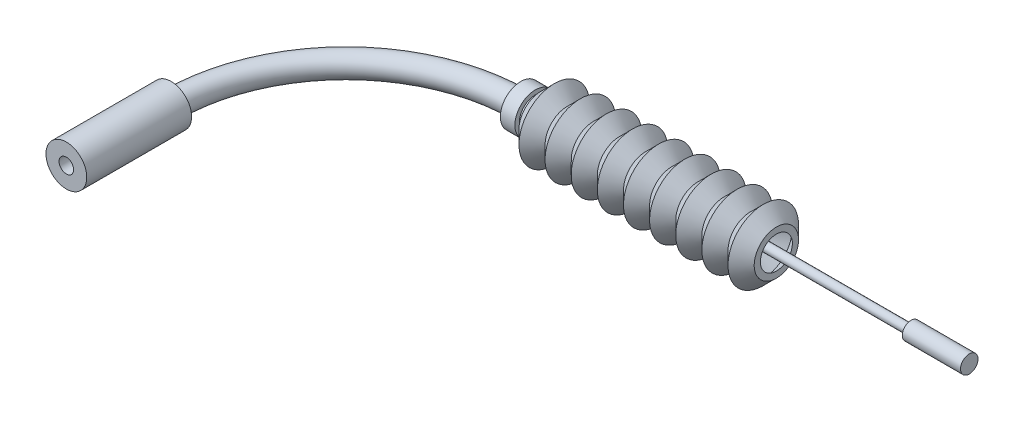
ISO-10303-21;
HEADER;
FILE_DESCRIPTION(('STEP AP214'),'2;1');
FILE_NAME('part.step','',(''),(''),'','','');
FILE_SCHEMA(('AUTOMOTIVE_DESIGN { 1 0 10303 214 1 1 1 1 }'));
ENDSEC;
DATA;
#1=APPLICATION_CONTEXT('core data for automotive mechanical design processes');
#2=APPLICATION_PROTOCOL_DEFINITION('international standard','automotive_design',2000,#1);
#3=PRODUCT_CONTEXT('',#1,'mechanical');
#4=PRODUCT('Part','Part','',(#3));
#5=PRODUCT_RELATED_PRODUCT_CATEGORY('part','',(#4));
#6=PRODUCT_DEFINITION_FORMATION('','',#4);
#7=PRODUCT_DEFINITION_CONTEXT('part definition',#1,'design');
#8=PRODUCT_DEFINITION('design','',#6,#7);
#9=PRODUCT_DEFINITION_SHAPE('','',#8);
#10=(LENGTH_UNIT() NAMED_UNIT(*) SI_UNIT(.MILLI.,.METRE.));
#11=(NAMED_UNIT(*) PLANE_ANGLE_UNIT() SI_UNIT($,.RADIAN.));
#12=(NAMED_UNIT(*) SI_UNIT($,.STERADIAN.) SOLID_ANGLE_UNIT());
#13=UNCERTAINTY_MEASURE_WITH_UNIT(LENGTH_MEASURE(1.E-05),#10,'distance_accuracy_value','');
#14=(GEOMETRIC_REPRESENTATION_CONTEXT(3) GLOBAL_UNCERTAINTY_ASSIGNED_CONTEXT((#13)) GLOBAL_UNIT_ASSIGNED_CONTEXT((#10,
#11,#12)) REPRESENTATION_CONTEXT('',''));
#15=CARTESIAN_POINT('',(0.,0.,0.));
#16=DIRECTION('',(0.,0.,1.));
#17=DIRECTION('',(1.,0.,0.));
#18=AXIS2_PLACEMENT_3D('',#15,#16,#17);
#19=CARTESIAN_POINT('',(77.,0.,-30.));
#20=DIRECTION('',(-1.,0.,0.));
#21=DIRECTION('',(0.,0.,1.));
#22=AXIS2_PLACEMENT_3D('',#19,#20,#21);
#23=CYLINDRICAL_SURFACE('',#22,0.750000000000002);
#24=CARTESIAN_POINT('',(7.,0.,-30.));
#25=DIRECTION('',(1.,0.,0.));
#26=DIRECTION('',(0.,0.,-1.));
#27=AXIS2_PLACEMENT_3D('',#24,#25,#26);
#28=CIRCLE('',#27,0.750000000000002);
#29=CARTESIAN_POINT('',(7.,0.,-30.75));
#30=VERTEX_POINT('',#29);
#31=EDGE_CURVE('E47',#30,#30,#28,.T.);
#32=ORIENTED_EDGE('',*,*,#31,.T.);
#33=EDGE_LOOP('',(#32));
#34=FACE_BOUND('',#33,.T.);
#35=CARTESIAN_POINT('',(67.,0.,-30.));
#36=DIRECTION('',(1.,0.,0.));
#37=DIRECTION('',(0.,0.,-1.));
#38=AXIS2_PLACEMENT_3D('',#35,#36,#37);
#39=CIRCLE('',#38,0.750000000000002);
#40=CARTESIAN_POINT('',(67.,0.,-30.75));
#41=VERTEX_POINT('',#40);
#42=EDGE_CURVE('E11',#41,#41,#39,.T.);
#43=ORIENTED_EDGE('',*,*,#42,.F.);
#44=EDGE_LOOP('',(#43));
#45=FACE_BOUND('',#44,.T.);
#46=ADVANCED_FACE('F41',(#34,#45),#23,.T.);
#47=CARTESIAN_POINT('',(7.,0.,-30.));
#48=DIRECTION('',(1.,0.,0.));
#49=DIRECTION('',(0.,0.,-1.));
#50=AXIS2_PLACEMENT_3D('',#47,#48,#49);
#51=PLANE('',#50);
#52=ORIENTED_EDGE('',*,*,#31,.F.);
#53=EDGE_LOOP('',(#52));
#54=FACE_BOUND('',#53,.T.);
#55=ADVANCED_FACE('F72',(#54),#51,.F.);
#56=CARTESIAN_POINT('',(67.,0.,-30.));
#57=DIRECTION('',(1.,0.,0.));
#58=DIRECTION('',(0.,0.,-1.));
#59=AXIS2_PLACEMENT_3D('',#56,#57,#58);
#60=PLANE('',#59);
#61=CARTESIAN_POINT('',(67.,0.,-30.));
#62=DIRECTION('',(1.,0.,0.));
#63=DIRECTION('',(0.,0.,-1.));
#64=AXIS2_PLACEMENT_3D('',#61,#62,#63);
#65=CIRCLE('',#64,1.5);
#66=CARTESIAN_POINT('',(67.,0.,-31.5));
#67=VERTEX_POINT('',#66);
#68=EDGE_CURVE('E51',#67,#67,#65,.T.);
#69=ORIENTED_EDGE('',*,*,#68,.F.);
#70=EDGE_LOOP('',(#69));
#71=FACE_BOUND('',#70,.T.);
#72=ORIENTED_EDGE('',*,*,#42,.T.);
#73=EDGE_LOOP('',(#72));
#74=FACE_BOUND('',#73,.T.);
#75=ADVANCED_FACE('F65',(#71,#74),#60,.F.);
#76=CARTESIAN_POINT('',(67.,0.,-30.));
#77=DIRECTION('',(1.,0.,0.));
#78=DIRECTION('',(0.,0.,-1.));
#79=AXIS2_PLACEMENT_3D('',#76,#77,#78);
#80=CYLINDRICAL_SURFACE('',#79,1.5);
#81=ORIENTED_EDGE('',*,*,#68,.T.);
#82=EDGE_LOOP('',(#81));
#83=FACE_BOUND('',#82,.T.);
#84=CARTESIAN_POINT('',(77.,0.,-30.));
#85=DIRECTION('',(1.,0.,0.));
#86=DIRECTION('',(0.,0.,-1.));
#87=AXIS2_PLACEMENT_3D('',#84,#85,#86);
#88=CIRCLE('',#87,1.5);
#89=CARTESIAN_POINT('',(77.,0.,-31.5));
#90=VERTEX_POINT('',#89);
#91=EDGE_CURVE('E55',#90,#90,#88,.T.);
#92=ORIENTED_EDGE('',*,*,#91,.F.);
#93=EDGE_LOOP('',(#92));
#94=FACE_BOUND('',#93,.T.);
#95=ADVANCED_FACE('F63',(#83,#94),#80,.T.);
#96=CARTESIAN_POINT('',(77.,0.,-30.));
#97=DIRECTION('',(1.,0.,0.));
#98=DIRECTION('',(0.,0.,-1.));
#99=AXIS2_PLACEMENT_3D('',#96,#97,#98);
#100=PLANE('',#99);
#101=ORIENTED_EDGE('',*,*,#91,.T.);
#102=EDGE_LOOP('',(#101));
#103=FACE_BOUND('',#102,.T.);
#104=ADVANCED_FACE('F61',(#103),#100,.T.);
#105=CLOSED_SHELL('',(#46,#55,#75,#95,#104));
#106=MANIFOLD_SOLID_BREP('B2',#105);
#107=CARTESIAN_POINT('',(28.1772718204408,0.,-30.));
#108=DIRECTION('',(1.,0.,0.));
#109=DIRECTION('',(0.,0.,-1.));
#110=AXIS2_PLACEMENT_3D('',#107,#108,#109);
#111=CONICAL_SURFACE('',#110,6.05165995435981,0.787019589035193);
#112=CARTESIAN_POINT('',(25.9418174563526,0.,-30.));
#113=DIRECTION('',(1.,0.,0.));
#114=DIRECTION('',(0.,0.,-1.));
#115=AXIS2_PLACEMENT_3D('',#112,#113,#114);
#116=CIRCLE('',#115,3.80894456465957);
#117=CARTESIAN_POINT('',(25.9418174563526,0.,-33.8089445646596));
#118=VERTEX_POINT('',#117);
#119=EDGE_CURVE('E240',#118,#118,#116,.T.);
#120=ORIENTED_EDGE('',*,*,#119,.T.);
#121=EDGE_LOOP('',(#120));
#122=FACE_BOUND('',#121,.T.);
#123=CARTESIAN_POINT('',(28.1772718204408,0.,-30.));
#124=DIRECTION('',(1.,0.,0.));
#125=DIRECTION('',(0.,0.,-1.));
#126=AXIS2_PLACEMENT_3D('',#123,#124,#125);
#127=CIRCLE('',#126,6.05165995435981);
#128=CARTESIAN_POINT('',(28.1772718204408,0.,-36.0516599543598));
#129=VERTEX_POINT('',#128);
#130=EDGE_CURVE('E40',#129,#129,#127,.T.);
#131=ORIENTED_EDGE('',*,*,#130,.F.);
#132=EDGE_LOOP('',(#131));
#133=FACE_BOUND('',#132,.T.);
#134=ADVANCED_FACE('F122',(#122,#133),#111,.T.);
#135=CARTESIAN_POINT('',(30.4272718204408,0.,-30.));
#136=DIRECTION('',(-1.,0.,0.));
#137=DIRECTION('',(0.,0.,1.));
#138=AXIS2_PLACEMENT_3D('',#135,#136,#137);
#139=CONICAL_SURFACE('',#138,3.80894456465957,0.783776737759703);
#140=ORIENTED_EDGE('',*,*,#130,.T.);
#141=EDGE_LOOP('',(#140));
#142=FACE_BOUND('',#141,.T.);
#143=CARTESIAN_POINT('',(30.4272718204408,0.,-30.));
#144=DIRECTION('',(1.,0.,0.));
#145=DIRECTION('',(0.,0.,-1.));
#146=AXIS2_PLACEMENT_3D('',#143,#144,#145);
#147=CIRCLE('',#146,3.80894456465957);
#148=CARTESIAN_POINT('',(30.4272718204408,0.,-33.8089445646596));
#149=VERTEX_POINT('',#148);
#150=EDGE_CURVE('E128',#149,#149,#147,.T.);
#151=ORIENTED_EDGE('',*,*,#150,.F.);
#152=EDGE_LOOP('',(#151));
#153=FACE_BOUND('',#152,.T.);
#154=ADVANCED_FACE('F258',(#142,#153),#139,.T.);
#155=CARTESIAN_POINT('',(32.6627261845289,0.,-30.));
#156=DIRECTION('',(1.,0.,0.));
#157=DIRECTION('',(0.,0.,-1.));
#158=AXIS2_PLACEMENT_3D('',#155,#156,#157);
#159=CONICAL_SURFACE('',#158,6.05165995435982,0.787019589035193);
#160=ORIENTED_EDGE('',*,*,#150,.T.);
#161=EDGE_LOOP('',(#160));
#162=FACE_BOUND('',#161,.T.);
#163=CARTESIAN_POINT('',(32.6627261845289,0.,-30.));
#164=DIRECTION('',(1.,0.,0.));
#165=DIRECTION('',(0.,0.,-1.));
#166=AXIS2_PLACEMENT_3D('',#163,#164,#165);
#167=CIRCLE('',#166,6.05165995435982);
#168=CARTESIAN_POINT('',(32.6627261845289,0.,-36.0516599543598));
#169=VERTEX_POINT('',#168);
#170=EDGE_CURVE('E132',#169,#169,#167,.T.);
#171=ORIENTED_EDGE('',*,*,#170,.F.);
#172=EDGE_LOOP('',(#171));
#173=FACE_BOUND('',#172,.T.);
#174=ADVANCED_FACE('F262',(#162,#173),#159,.T.);
#175=CARTESIAN_POINT('',(34.9127261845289,0.,-30.));
#176=DIRECTION('',(-1.,0.,0.));
#177=DIRECTION('',(0.,0.,1.));
#178=AXIS2_PLACEMENT_3D('',#175,#176,#177);
#179=CONICAL_SURFACE('',#178,3.80894456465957,0.783776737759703);
#180=ORIENTED_EDGE('',*,*,#170,.T.);
#181=EDGE_LOOP('',(#180));
#182=FACE_BOUND('',#181,.T.);
#183=CARTESIAN_POINT('',(34.9127261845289,0.,-30.));
#184=DIRECTION('',(1.,0.,0.));
#185=DIRECTION('',(0.,0.,-1.));
#186=AXIS2_PLACEMENT_3D('',#183,#184,#185);
#187=CIRCLE('',#186,3.80894456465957);
#188=CARTESIAN_POINT('',(34.9127261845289,0.,-33.8089445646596));
#189=VERTEX_POINT('',#188);
#190=EDGE_CURVE('E136',#189,#189,#187,.T.);
#191=ORIENTED_EDGE('',*,*,#190,.F.);
#192=EDGE_LOOP('',(#191));
#193=FACE_BOUND('',#192,.T.);
#194=ADVANCED_FACE('F266',(#182,#193),#179,.T.);
#195=CARTESIAN_POINT('',(37.1481805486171,0.,-30.));
#196=DIRECTION('',(1.,0.,0.));
#197=DIRECTION('',(0.,0.,-1.));
#198=AXIS2_PLACEMENT_3D('',#195,#196,#197);
#199=CONICAL_SURFACE('',#198,6.05165995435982,0.787019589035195);
#200=ORIENTED_EDGE('',*,*,#190,.T.);
#201=EDGE_LOOP('',(#200));
#202=FACE_BOUND('',#201,.T.);
#203=CARTESIAN_POINT('',(37.1481805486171,0.,-30.));
#204=DIRECTION('',(1.,0.,0.));
#205=DIRECTION('',(0.,0.,-1.));
#206=AXIS2_PLACEMENT_3D('',#203,#204,#205);
#207=CIRCLE('',#206,6.05165995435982);
#208=CARTESIAN_POINT('',(37.1481805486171,0.,-36.0516599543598));
#209=VERTEX_POINT('',#208);
#210=EDGE_CURVE('E141',#209,#209,#207,.T.);
#211=ORIENTED_EDGE('',*,*,#210,.F.);
#212=EDGE_LOOP('',(#211));
#213=FACE_BOUND('',#212,.T.);
#214=ADVANCED_FACE('F272',(#202,#213),#199,.T.);
#215=CARTESIAN_POINT('',(39.399900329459,0.,-30.));
#216=DIRECTION('',(-1.,0.,0.));
#217=DIRECTION('',(0.,0.,1.));
#218=AXIS2_PLACEMENT_3D('',#215,#216,#217);
#219=CONICAL_SURFACE('',#218,3.80723035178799,0.783776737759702);
#220=ORIENTED_EDGE('',*,*,#210,.T.);
#221=EDGE_LOOP('',(#220));
#222=FACE_BOUND('',#221,.T.);
#223=CARTESIAN_POINT('',(39.399900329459,0.,-30.));
#224=DIRECTION('',(1.,0.,0.));
#225=DIRECTION('',(0.,0.,-1.));
#226=AXIS2_PLACEMENT_3D('',#223,#224,#225);
#227=CIRCLE('',#226,3.80723035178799);
#228=CARTESIAN_POINT('',(39.399900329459,0.,-33.807230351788));
#229=VERTEX_POINT('',#228);
#230=EDGE_CURVE('E144',#229,#229,#227,.T.);
#231=ORIENTED_EDGE('',*,*,#230,.F.);
#232=EDGE_LOOP('',(#231));
#233=FACE_BOUND('',#232,.T.);
#234=ADVANCED_FACE('F276',(#222,#233),#219,.T.);
#235=CARTESIAN_POINT('',(41.6353546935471,0.,-30.));
#236=DIRECTION('',(1.,0.,0.));
#237=DIRECTION('',(0.,0.,-1.));
#238=AXIS2_PLACEMENT_3D('',#235,#236,#237);
#239=CONICAL_SURFACE('',#238,6.04994574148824,0.787019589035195);
#240=ORIENTED_EDGE('',*,*,#230,.T.);
#241=EDGE_LOOP('',(#240));
#242=FACE_BOUND('',#241,.T.);
#243=CARTESIAN_POINT('',(41.6353546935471,0.,-30.));
#244=DIRECTION('',(1.,0.,0.));
#245=DIRECTION('',(0.,0.,-1.));
#246=AXIS2_PLACEMENT_3D('',#243,#244,#245);
#247=CIRCLE('',#246,6.04994574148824);
#248=CARTESIAN_POINT('',(41.6353546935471,0.,-36.0499457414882));
#249=VERTEX_POINT('',#248);
#250=EDGE_CURVE('E147',#249,#249,#247,.T.);
#251=ORIENTED_EDGE('',*,*,#250,.F.);
#252=EDGE_LOOP('',(#251));
#253=FACE_BOUND('',#252,.T.);
#254=ADVANCED_FACE('F280',(#242,#253),#239,.T.);
#255=CARTESIAN_POINT('',(43.887074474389,0.,-30.));
#256=DIRECTION('',(-1.,0.,0.));
#257=DIRECTION('',(0.,0.,1.));
#258=AXIS2_PLACEMENT_3D('',#255,#256,#257);
#259=CONICAL_SURFACE('',#258,3.80551613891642,0.783776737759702);
#260=ORIENTED_EDGE('',*,*,#250,.T.);
#261=EDGE_LOOP('',(#260));
#262=FACE_BOUND('',#261,.T.);
#263=CARTESIAN_POINT('',(43.887074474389,0.,-30.));
#264=DIRECTION('',(1.,0.,0.));
#265=DIRECTION('',(0.,0.,-1.));
#266=AXIS2_PLACEMENT_3D('',#263,#264,#265);
#267=CIRCLE('',#266,3.80551613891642);
#268=CARTESIAN_POINT('',(43.887074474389,0.,-33.8055161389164));
#269=VERTEX_POINT('',#268);
#270=EDGE_CURVE('E150',#269,#269,#267,.T.);
#271=ORIENTED_EDGE('',*,*,#270,.F.);
#272=EDGE_LOOP('',(#271));
#273=FACE_BOUND('',#272,.T.);
#274=ADVANCED_FACE('F284',(#262,#273),#259,.T.);
#275=CARTESIAN_POINT('',(43.887074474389,3.80551613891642,-30.));
#276=DIRECTION('',(1.,0.,0.));
#277=DIRECTION('',(0.,0.,-1.));
#278=AXIS2_PLACEMENT_3D('',#275,#276,#277);
#279=PLANE('',#278);
#280=ORIENTED_EDGE('',*,*,#270,.T.);
#281=EDGE_LOOP('',(#280));
#282=FACE_BOUND('',#281,.T.);
#283=CARTESIAN_POINT('',(43.887074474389,0.,-30.));
#284=DIRECTION('',(1.,0.,0.));
#285=DIRECTION('',(0.,0.,-1.));
#286=AXIS2_PLACEMENT_3D('',#283,#284,#285);
#287=CIRCLE('',#286,2.74657157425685);
#288=CARTESIAN_POINT('',(43.887074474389,0.,-32.7465715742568));
#289=VERTEX_POINT('',#288);
#290=EDGE_CURVE('E153',#289,#289,#287,.T.);
#291=ORIENTED_EDGE('',*,*,#290,.F.);
#292=EDGE_LOOP('',(#291));
#293=FACE_BOUND('',#292,.T.);
#294=ADVANCED_FACE('F288',(#282,#293),#279,.T.);
#295=CARTESIAN_POINT('',(41.6370744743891,0.,-30.));
#296=DIRECTION('',(-1.,0.,0.));
#297=DIRECTION('',(0.,0.,1.));
#298=AXIS2_PLACEMENT_3D('',#295,#296,#297);
#299=CONICAL_SURFACE('',#298,4.98928696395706,0.783776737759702);
#300=ORIENTED_EDGE('',*,*,#290,.T.);
#301=EDGE_LOOP('',(#300));
#302=FACE_BOUND('',#301,.T.);
#303=CARTESIAN_POINT('',(41.6370744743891,0.,-30.));
#304=DIRECTION('',(1.,0.,0.));
#305=DIRECTION('',(0.,0.,-1.));
#306=AXIS2_PLACEMENT_3D('',#303,#304,#305);
#307=CIRCLE('',#306,4.98928696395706);
#308=CARTESIAN_POINT('',(41.6370744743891,0.,-34.9892869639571));
#309=VERTEX_POINT('',#308);
#310=EDGE_CURVE('E156',#309,#309,#307,.T.);
#311=ORIENTED_EDGE('',*,*,#310,.F.);
#312=EDGE_LOOP('',(#311));
#313=FACE_BOUND('',#312,.T.);
#314=ADVANCED_FACE('F292',(#302,#313),#299,.F.);
#315=CARTESIAN_POINT('',(39.4016201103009,0.,-30.));
#316=DIRECTION('',(1.,0.,0.));
#317=DIRECTION('',(0.,0.,-1.));
#318=AXIS2_PLACEMENT_3D('',#315,#316,#317);
#319=CONICAL_SURFACE('',#318,2.74657157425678,0.78701958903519);
#320=ORIENTED_EDGE('',*,*,#310,.T.);
#321=EDGE_LOOP('',(#320));
#322=FACE_BOUND('',#321,.T.);
#323=CARTESIAN_POINT('',(39.4016201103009,0.,-30.));
#324=DIRECTION('',(1.,0.,0.));
#325=DIRECTION('',(0.,0.,-1.));
#326=AXIS2_PLACEMENT_3D('',#323,#324,#325);
#327=CIRCLE('',#326,2.74657157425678);
#328=CARTESIAN_POINT('',(39.4016201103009,0.,-32.7465715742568));
#329=VERTEX_POINT('',#328);
#330=EDGE_CURVE('E159',#329,#329,#327,.T.);
#331=ORIENTED_EDGE('',*,*,#330,.F.);
#332=EDGE_LOOP('',(#331));
#333=FACE_BOUND('',#332,.T.);
#334=ADVANCED_FACE('F296',(#322,#333),#319,.F.);
#335=CARTESIAN_POINT('',(37.149900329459,0.,-30.));
#336=DIRECTION('',(-1.,0.,0.));
#337=DIRECTION('',(0.,0.,1.));
#338=AXIS2_PLACEMENT_3D('',#335,#336,#337);
#339=CONICAL_SURFACE('',#338,4.99100117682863,0.783776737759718);
#340=ORIENTED_EDGE('',*,*,#330,.T.);
#341=EDGE_LOOP('',(#340));
#342=FACE_BOUND('',#341,.T.);
#343=CARTESIAN_POINT('',(37.149900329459,0.,-30.));
#344=DIRECTION('',(1.,0.,0.));
#345=DIRECTION('',(0.,0.,-1.));
#346=AXIS2_PLACEMENT_3D('',#343,#344,#345);
#347=CIRCLE('',#346,4.99100117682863);
#348=CARTESIAN_POINT('',(37.149900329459,0.,-34.9910011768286));
#349=VERTEX_POINT('',#348);
#350=EDGE_CURVE('E162',#349,#349,#347,.T.);
#351=ORIENTED_EDGE('',*,*,#350,.F.);
#352=EDGE_LOOP('',(#351));
#353=FACE_BOUND('',#352,.T.);
#354=ADVANCED_FACE('F300',(#342,#353),#339,.F.);
#355=CARTESIAN_POINT('',(34.9144459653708,0.,-30.));
#356=DIRECTION('',(1.,0.,0.));
#357=DIRECTION('',(0.,0.,-1.));
#358=AXIS2_PLACEMENT_3D('',#355,#356,#357);
#359=CONICAL_SURFACE('',#358,2.74828578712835,0.78701958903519);
#360=ORIENTED_EDGE('',*,*,#350,.T.);
#361=EDGE_LOOP('',(#360));
#362=FACE_BOUND('',#361,.T.);
#363=CARTESIAN_POINT('',(34.9144459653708,0.,-30.));
#364=DIRECTION('',(1.,0.,0.));
#365=DIRECTION('',(0.,0.,-1.));
#366=AXIS2_PLACEMENT_3D('',#363,#364,#365);
#367=CIRCLE('',#366,2.74828578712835);
#368=CARTESIAN_POINT('',(34.9144459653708,0.,-32.7482857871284));
#369=VERTEX_POINT('',#368);
#370=EDGE_CURVE('E165',#369,#369,#367,.T.);
#371=ORIENTED_EDGE('',*,*,#370,.F.);
#372=EDGE_LOOP('',(#371));
#373=FACE_BOUND('',#372,.T.);
#374=ADVANCED_FACE('F304',(#362,#373),#359,.F.);
#375=CARTESIAN_POINT('',(32.6644459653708,0.,-30.));
#376=DIRECTION('',(-1.,0.,0.));
#377=DIRECTION('',(0.,0.,1.));
#378=AXIS2_PLACEMENT_3D('',#375,#376,#377);
#379=CONICAL_SURFACE('',#378,4.99100117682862,0.783776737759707);
#380=ORIENTED_EDGE('',*,*,#370,.T.);
#381=EDGE_LOOP('',(#380));
#382=FACE_BOUND('',#381,.T.);
#383=CARTESIAN_POINT('',(32.6644459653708,0.,-30.));
#384=DIRECTION('',(1.,0.,0.));
#385=DIRECTION('',(0.,0.,-1.));
#386=AXIS2_PLACEMENT_3D('',#383,#384,#385);
#387=CIRCLE('',#386,4.99100117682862);
#388=CARTESIAN_POINT('',(32.6644459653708,0.,-34.9910011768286));
#389=VERTEX_POINT('',#388);
#390=EDGE_CURVE('E168',#389,#389,#387,.T.);
#391=ORIENTED_EDGE('',*,*,#390,.F.);
#392=EDGE_LOOP('',(#391));
#393=FACE_BOUND('',#392,.T.);
#394=ADVANCED_FACE('F308',(#382,#393),#379,.F.);
#395=CARTESIAN_POINT('',(30.4289916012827,0.,-30.));
#396=DIRECTION('',(1.,0.,0.));
#397=DIRECTION('',(0.,0.,-1.));
#398=AXIS2_PLACEMENT_3D('',#395,#396,#397);
#399=CONICAL_SURFACE('',#398,2.74828578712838,0.78701958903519);
#400=ORIENTED_EDGE('',*,*,#390,.T.);
#401=EDGE_LOOP('',(#400));
#402=FACE_BOUND('',#401,.T.);
#403=CARTESIAN_POINT('',(30.4289916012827,0.,-30.));
#404=DIRECTION('',(1.,0.,0.));
#405=DIRECTION('',(0.,0.,-1.));
#406=AXIS2_PLACEMENT_3D('',#403,#404,#405);
#407=CIRCLE('',#406,2.74828578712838);
#408=CARTESIAN_POINT('',(30.4289916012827,0.,-32.7482857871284));
#409=VERTEX_POINT('',#408);
#410=EDGE_CURVE('E171',#409,#409,#407,.T.);
#411=ORIENTED_EDGE('',*,*,#410,.F.);
#412=EDGE_LOOP('',(#411));
#413=FACE_BOUND('',#412,.T.);
#414=ADVANCED_FACE('F312',(#402,#413),#399,.F.);
#415=CARTESIAN_POINT('',(28.1789916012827,0.,-30.));
#416=DIRECTION('',(-1.,0.,0.));
#417=DIRECTION('',(0.,0.,1.));
#418=AXIS2_PLACEMENT_3D('',#415,#416,#417);
#419=CONICAL_SURFACE('',#418,4.99100117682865,0.783776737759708);
#420=ORIENTED_EDGE('',*,*,#410,.T.);
#421=EDGE_LOOP('',(#420));
#422=FACE_BOUND('',#421,.T.);
#423=CARTESIAN_POINT('',(28.1789916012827,0.,-30.));
#424=DIRECTION('',(1.,0.,0.));
#425=DIRECTION('',(0.,0.,-1.));
#426=AXIS2_PLACEMENT_3D('',#423,#424,#425);
#427=CIRCLE('',#426,4.99100117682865);
#428=CARTESIAN_POINT('',(28.1789916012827,0.,-34.9910011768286));
#429=VERTEX_POINT('',#428);
#430=EDGE_CURVE('E174',#429,#429,#427,.T.);
#431=ORIENTED_EDGE('',*,*,#430,.F.);
#432=EDGE_LOOP('',(#431));
#433=FACE_BOUND('',#432,.T.);
#434=ADVANCED_FACE('F316',(#422,#433),#419,.F.);
#435=CARTESIAN_POINT('',(25.9435372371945,0.,-30.));
#436=DIRECTION('',(1.,0.,0.));
#437=DIRECTION('',(0.,0.,-1.));
#438=AXIS2_PLACEMENT_3D('',#435,#436,#437);
#439=CONICAL_SURFACE('',#438,2.74828578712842,0.787019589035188);
#440=ORIENTED_EDGE('',*,*,#430,.T.);
#441=EDGE_LOOP('',(#440));
#442=FACE_BOUND('',#441,.T.);
#443=CARTESIAN_POINT('',(25.9435372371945,0.,-30.));
#444=DIRECTION('',(1.,0.,0.));
#445=DIRECTION('',(0.,0.,-1.));
#446=AXIS2_PLACEMENT_3D('',#443,#444,#445);
#447=CIRCLE('',#446,2.74828578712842);
#448=CARTESIAN_POINT('',(25.9435372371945,0.,-32.7482857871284));
#449=VERTEX_POINT('',#448);
#450=EDGE_CURVE('E177',#449,#449,#447,.T.);
#451=ORIENTED_EDGE('',*,*,#450,.F.);
#452=EDGE_LOOP('',(#451));
#453=FACE_BOUND('',#452,.T.);
#454=ADVANCED_FACE('F320',(#442,#453),#439,.F.);
#455=CARTESIAN_POINT('',(23.6918174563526,0.,-30.));
#456=DIRECTION('',(-1.,0.,0.));
#457=DIRECTION('',(0.,0.,1.));
#458=AXIS2_PLACEMENT_3D('',#455,#456,#457);
#459=CONICAL_SURFACE('',#458,4.99271538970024,0.783776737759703);
#460=ORIENTED_EDGE('',*,*,#450,.T.);
#461=EDGE_LOOP('',(#460));
#462=FACE_BOUND('',#461,.T.);
#463=CARTESIAN_POINT('',(23.6918174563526,0.,-30.));
#464=DIRECTION('',(1.,0.,0.));
#465=DIRECTION('',(0.,0.,-1.));
#466=AXIS2_PLACEMENT_3D('',#463,#464,#465);
#467=CIRCLE('',#466,4.99271538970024);
#468=CARTESIAN_POINT('',(23.6918174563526,0.,-34.9927153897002));
#469=VERTEX_POINT('',#468);
#470=EDGE_CURVE('E180',#469,#469,#467,.T.);
#471=ORIENTED_EDGE('',*,*,#470,.F.);
#472=EDGE_LOOP('',(#471));
#473=FACE_BOUND('',#472,.T.);
#474=ADVANCED_FACE('F324',(#462,#473),#459,.F.);
#475=CARTESIAN_POINT('',(21.4563630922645,0.,-30.));
#476=DIRECTION('',(1.,0.,0.));
#477=DIRECTION('',(0.,0.,-1.));
#478=AXIS2_PLACEMENT_3D('',#475,#476,#477);
#479=CONICAL_SURFACE('',#478,2.74999999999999,0.787019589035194);
#480=ORIENTED_EDGE('',*,*,#470,.T.);
#481=EDGE_LOOP('',(#480));
#482=FACE_BOUND('',#481,.T.);
#483=CARTESIAN_POINT('',(21.4563630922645,0.,-30.));
#484=DIRECTION('',(1.,0.,0.));
#485=DIRECTION('',(0.,0.,-1.));
#486=AXIS2_PLACEMENT_3D('',#483,#484,#485);
#487=CIRCLE('',#486,2.74999999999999);
#488=CARTESIAN_POINT('',(21.4563630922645,0.,-32.75));
#489=VERTEX_POINT('',#488);
#490=EDGE_CURVE('E183',#489,#489,#487,.T.);
#491=ORIENTED_EDGE('',*,*,#490,.F.);
#492=EDGE_LOOP('',(#491));
#493=FACE_BOUND('',#492,.T.);
#494=ADVANCED_FACE('F328',(#482,#493),#479,.F.);
#495=CARTESIAN_POINT('',(19.2063630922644,0.,-30.));
#496=DIRECTION('',(-1.,0.,0.));
#497=DIRECTION('',(0.,0.,1.));
#498=AXIS2_PLACEMENT_3D('',#495,#496,#497);
#499=CONICAL_SURFACE('',#498,4.99271538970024,0.783776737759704);
#500=ORIENTED_EDGE('',*,*,#490,.T.);
#501=EDGE_LOOP('',(#500));
#502=FACE_BOUND('',#501,.T.);
#503=CARTESIAN_POINT('',(19.2063630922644,0.,-30.));
#504=DIRECTION('',(1.,0.,0.));
#505=DIRECTION('',(0.,0.,-1.));
#506=AXIS2_PLACEMENT_3D('',#503,#504,#505);
#507=CIRCLE('',#506,4.99271538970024);
#508=CARTESIAN_POINT('',(19.2063630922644,0.,-34.9927153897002));
#509=VERTEX_POINT('',#508);
#510=EDGE_CURVE('E186',#509,#509,#507,.T.);
#511=ORIENTED_EDGE('',*,*,#510,.F.);
#512=EDGE_LOOP('',(#511));
#513=FACE_BOUND('',#512,.T.);
#514=ADVANCED_FACE('F332',(#502,#513),#499,.F.);
#515=CARTESIAN_POINT('',(16.9709087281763,0.,-30.));
#516=DIRECTION('',(1.,0.,0.));
#517=DIRECTION('',(0.,0.,-1.));
#518=AXIS2_PLACEMENT_3D('',#515,#516,#517);
#519=CONICAL_SURFACE('',#518,2.74999999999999,0.787019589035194);
#520=ORIENTED_EDGE('',*,*,#510,.T.);
#521=EDGE_LOOP('',(#520));
#522=FACE_BOUND('',#521,.T.);
#523=CARTESIAN_POINT('',(16.9709087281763,0.,-30.));
#524=DIRECTION('',(1.,0.,0.));
#525=DIRECTION('',(0.,0.,-1.));
#526=AXIS2_PLACEMENT_3D('',#523,#524,#525);
#527=CIRCLE('',#526,2.74999999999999);
#528=CARTESIAN_POINT('',(16.9709087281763,0.,-32.75));
#529=VERTEX_POINT('',#528);
#530=EDGE_CURVE('E189',#529,#529,#527,.T.);
#531=ORIENTED_EDGE('',*,*,#530,.F.);
#532=EDGE_LOOP('',(#531));
#533=FACE_BOUND('',#532,.T.);
#534=ADVANCED_FACE('F336',(#522,#533),#519,.F.);
#535=CARTESIAN_POINT('',(14.7209087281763,0.,-30.));
#536=DIRECTION('',(-1.,0.,0.));
#537=DIRECTION('',(0.,0.,1.));
#538=AXIS2_PLACEMENT_3D('',#535,#536,#537);
#539=CONICAL_SURFACE('',#538,4.99271538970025,0.783776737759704);
#540=ORIENTED_EDGE('',*,*,#530,.T.);
#541=EDGE_LOOP('',(#540));
#542=FACE_BOUND('',#541,.T.);
#543=CARTESIAN_POINT('',(14.7209087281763,0.,-30.));
#544=DIRECTION('',(1.,0.,0.));
#545=DIRECTION('',(0.,0.,-1.));
#546=AXIS2_PLACEMENT_3D('',#543,#544,#545);
#547=CIRCLE('',#546,4.99271538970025);
#548=CARTESIAN_POINT('',(14.7209087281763,0.,-34.9927153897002));
#549=VERTEX_POINT('',#548);
#550=EDGE_CURVE('E192',#549,#549,#547,.T.);
#551=ORIENTED_EDGE('',*,*,#550,.F.);
#552=EDGE_LOOP('',(#551));
#553=FACE_BOUND('',#552,.T.);
#554=ADVANCED_FACE('F340',(#542,#553),#539,.F.);
#555=CARTESIAN_POINT('',(12.4854543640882,0.,-30.));
#556=DIRECTION('',(1.,0.,0.));
#557=DIRECTION('',(0.,0.,-1.));
#558=AXIS2_PLACEMENT_3D('',#555,#556,#557);
#559=CONICAL_SURFACE('',#558,2.75,0.787019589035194);
#560=ORIENTED_EDGE('',*,*,#550,.T.);
#561=EDGE_LOOP('',(#560));
#562=FACE_BOUND('',#561,.T.);
#563=CARTESIAN_POINT('',(12.4854543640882,0.,-30.));
#564=DIRECTION('',(1.,0.,0.));
#565=DIRECTION('',(0.,0.,-1.));
#566=AXIS2_PLACEMENT_3D('',#563,#564,#565);
#567=CIRCLE('',#566,2.75);
#568=CARTESIAN_POINT('',(12.4854543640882,0.,-32.75));
#569=VERTEX_POINT('',#568);
#570=EDGE_CURVE('E195',#569,#569,#567,.T.);
#571=ORIENTED_EDGE('',*,*,#570,.F.);
#572=EDGE_LOOP('',(#571));
#573=FACE_BOUND('',#572,.T.);
#574=ADVANCED_FACE('F344',(#562,#573),#559,.F.);
#575=CARTESIAN_POINT('',(10.2354543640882,0.,-30.));
#576=DIRECTION('',(-1.,0.,0.));
#577=DIRECTION('',(0.,0.,1.));
#578=AXIS2_PLACEMENT_3D('',#575,#576,#577);
#579=CONICAL_SURFACE('',#578,4.99271538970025,0.783776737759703);
#580=ORIENTED_EDGE('',*,*,#570,.T.);
#581=EDGE_LOOP('',(#580));
#582=FACE_BOUND('',#581,.T.);
#583=CARTESIAN_POINT('',(10.2354543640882,0.,-30.));
#584=DIRECTION('',(1.,0.,0.));
#585=DIRECTION('',(0.,0.,-1.));
#586=AXIS2_PLACEMENT_3D('',#583,#584,#585);
#587=CIRCLE('',#586,4.99271538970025);
#588=CARTESIAN_POINT('',(10.2354543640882,0.,-34.9927153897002));
#589=VERTEX_POINT('',#588);
#590=EDGE_CURVE('E198',#589,#589,#587,.T.);
#591=ORIENTED_EDGE('',*,*,#590,.F.);
#592=EDGE_LOOP('',(#591));
#593=FACE_BOUND('',#592,.T.);
#594=ADVANCED_FACE('F348',(#582,#593),#579,.F.);
#595=CARTESIAN_POINT('',(8.,0.,-30.));
#596=DIRECTION('',(1.,0.,0.));
#597=DIRECTION('',(0.,0.,-1.));
#598=AXIS2_PLACEMENT_3D('',#595,#596,#597);
#599=CONICAL_SURFACE('',#598,2.75,0.787019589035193);
#600=ORIENTED_EDGE('',*,*,#590,.T.);
#601=EDGE_LOOP('',(#600));
#602=FACE_BOUND('',#601,.T.);
#603=CARTESIAN_POINT('',(8.,0.,-30.));
#604=DIRECTION('',(1.,0.,0.));
#605=DIRECTION('',(0.,0.,-1.));
#606=AXIS2_PLACEMENT_3D('',#603,#604,#605);
#607=CIRCLE('',#606,2.75);
#608=CARTESIAN_POINT('',(8.,0.,-32.75));
#609=VERTEX_POINT('',#608);
#610=EDGE_CURVE('E201',#609,#609,#607,.T.);
#611=ORIENTED_EDGE('',*,*,#610,.F.);
#612=EDGE_LOOP('',(#611));
#613=FACE_BOUND('',#612,.T.);
#614=ADVANCED_FACE('F352',(#602,#613),#599,.F.);
#615=CARTESIAN_POINT('',(5.75,0.,-30.));
#616=DIRECTION('',(-1.,0.,0.));
#617=DIRECTION('',(0.,0.,1.));
#618=AXIS2_PLACEMENT_3D('',#615,#616,#617);
#619=CONICAL_SURFACE('',#618,4.99271538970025,0.783776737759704);
#620=ORIENTED_EDGE('',*,*,#610,.T.);
#621=EDGE_LOOP('',(#620));
#622=FACE_BOUND('',#621,.T.);
#623=CARTESIAN_POINT('',(5.75,0.,-30.));
#624=DIRECTION('',(1.,0.,0.));
#625=DIRECTION('',(0.,0.,-1.));
#626=AXIS2_PLACEMENT_3D('',#623,#624,#625);
#627=CIRCLE('',#626,4.99271538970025);
#628=CARTESIAN_POINT('',(5.75,0.,-34.9927153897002));
#629=VERTEX_POINT('',#628);
#630=EDGE_CURVE('E204',#629,#629,#627,.T.);
#631=ORIENTED_EDGE('',*,*,#630,.F.);
#632=EDGE_LOOP('',(#631));
#633=FACE_BOUND('',#632,.T.);
#634=ADVANCED_FACE('F356',(#622,#633),#619,.F.);
#635=CARTESIAN_POINT('',(3.5,0.,-30.));
#636=DIRECTION('',(1.,0.,0.));
#637=DIRECTION('',(0.,0.,-1.));
#638=AXIS2_PLACEMENT_3D('',#635,#636,#637);
#639=CONICAL_SURFACE('',#638,2.75,0.783776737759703);
#640=ORIENTED_EDGE('',*,*,#630,.T.);
#641=EDGE_LOOP('',(#640));
#642=FACE_BOUND('',#641,.T.);
#643=CARTESIAN_POINT('',(3.5,0.,-30.));
#644=DIRECTION('',(1.,0.,0.));
#645=DIRECTION('',(0.,0.,-1.));
#646=AXIS2_PLACEMENT_3D('',#643,#644,#645);
#647=CIRCLE('',#646,2.75);
#648=CARTESIAN_POINT('',(3.5,0.,-32.75));
#649=VERTEX_POINT('',#648);
#650=EDGE_CURVE('E207',#649,#649,#647,.T.);
#651=ORIENTED_EDGE('',*,*,#650,.F.);
#652=EDGE_LOOP('',(#651));
#653=FACE_BOUND('',#652,.T.);
#654=ADVANCED_FACE('F360',(#642,#653),#639,.F.);
#655=CARTESIAN_POINT('',(3.5,2.75,-30.));
#656=DIRECTION('',(-1.,0.,0.));
#657=DIRECTION('',(0.,0.,1.));
#658=AXIS2_PLACEMENT_3D('',#655,#656,#657);
#659=PLANE('',#658);
#660=ORIENTED_EDGE('',*,*,#650,.T.);
#661=EDGE_LOOP('',(#660));
#662=FACE_BOUND('',#661,.T.);
#663=CARTESIAN_POINT('',(3.5,0.,-30.));
#664=DIRECTION('',(1.,0.,0.));
#665=DIRECTION('',(0.,0.,-1.));
#666=AXIS2_PLACEMENT_3D('',#663,#664,#665);
#667=CIRCLE('',#666,3.80894456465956);
#668=CARTESIAN_POINT('',(3.5,0.,-33.8089445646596));
#669=VERTEX_POINT('',#668);
#670=EDGE_CURVE('E210',#669,#669,#667,.T.);
#671=ORIENTED_EDGE('',*,*,#670,.F.);
#672=EDGE_LOOP('',(#671));
#673=FACE_BOUND('',#672,.T.);
#674=ADVANCED_FACE('F364',(#662,#673),#659,.T.);
#675=CARTESIAN_POINT('',(5.75,0.,-30.));
#676=DIRECTION('',(1.,0.,0.));
#677=DIRECTION('',(0.,0.,-1.));
#678=AXIS2_PLACEMENT_3D('',#675,#676,#677);
#679=CONICAL_SURFACE('',#678,6.05165995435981,0.783776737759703);
#680=ORIENTED_EDGE('',*,*,#670,.T.);
#681=EDGE_LOOP('',(#680));
#682=FACE_BOUND('',#681,.T.);
#683=CARTESIAN_POINT('',(5.75,0.,-30.));
#684=DIRECTION('',(1.,0.,0.));
#685=DIRECTION('',(0.,0.,-1.));
#686=AXIS2_PLACEMENT_3D('',#683,#684,#685);
#687=CIRCLE('',#686,6.05165995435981);
#688=CARTESIAN_POINT('',(5.75,0.,-36.0516599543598));
#689=VERTEX_POINT('',#688);
#690=EDGE_CURVE('E213',#689,#689,#687,.T.);
#691=ORIENTED_EDGE('',*,*,#690,.F.);
#692=EDGE_LOOP('',(#691));
#693=FACE_BOUND('',#692,.T.);
#694=ADVANCED_FACE('F368',(#682,#693),#679,.T.);
#695=CARTESIAN_POINT('',(7.99828021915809,0.,-30.));
#696=DIRECTION('',(-1.,0.,0.));
#697=DIRECTION('',(0.,0.,1.));
#698=AXIS2_PLACEMENT_3D('',#695,#696,#697);
#699=CONICAL_SURFACE('',#698,3.81065877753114,0.783776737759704);
#700=ORIENTED_EDGE('',*,*,#690,.T.);
#701=EDGE_LOOP('',(#700));
#702=FACE_BOUND('',#701,.T.);
#703=CARTESIAN_POINT('',(7.99828021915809,0.,-30.));
#704=DIRECTION('',(1.,0.,0.));
#705=DIRECTION('',(0.,0.,-1.));
#706=AXIS2_PLACEMENT_3D('',#703,#704,#705);
#707=CIRCLE('',#706,3.81065877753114);
#708=CARTESIAN_POINT('',(7.99828021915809,0.,-33.8106587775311));
#709=VERTEX_POINT('',#708);
#710=EDGE_CURVE('E216',#709,#709,#707,.T.);
#711=ORIENTED_EDGE('',*,*,#710,.F.);
#712=EDGE_LOOP('',(#711));
#713=FACE_BOUND('',#712,.T.);
#714=ADVANCED_FACE('F372',(#702,#713),#699,.T.);
#715=CARTESIAN_POINT('',(10.2337345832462,0.,-30.));
#716=DIRECTION('',(1.,0.,0.));
#717=DIRECTION('',(0.,0.,-1.));
#718=AXIS2_PLACEMENT_3D('',#715,#716,#717);
#719=CONICAL_SURFACE('',#718,6.05337416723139,0.787019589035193);
#720=ORIENTED_EDGE('',*,*,#710,.T.);
#721=EDGE_LOOP('',(#720));
#722=FACE_BOUND('',#721,.T.);
#723=CARTESIAN_POINT('',(10.2337345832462,0.,-30.));
#724=DIRECTION('',(1.,0.,0.));
#725=DIRECTION('',(0.,0.,-1.));
#726=AXIS2_PLACEMENT_3D('',#723,#724,#725);
#727=CIRCLE('',#726,6.05337416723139);
#728=CARTESIAN_POINT('',(10.2337345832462,0.,-36.0533741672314));
#729=VERTEX_POINT('',#728);
#730=EDGE_CURVE('E219',#729,#729,#727,.T.);
#731=ORIENTED_EDGE('',*,*,#730,.F.);
#732=EDGE_LOOP('',(#731));
#733=FACE_BOUND('',#732,.T.);
#734=ADVANCED_FACE('F376',(#722,#733),#719,.T.);
#735=CARTESIAN_POINT('',(12.4837345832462,0.,-30.));
#736=DIRECTION('',(-1.,0.,0.));
#737=DIRECTION('',(0.,0.,1.));
#738=AXIS2_PLACEMENT_3D('',#735,#736,#737);
#739=CONICAL_SURFACE('',#738,3.81065877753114,0.783776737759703);
#740=ORIENTED_EDGE('',*,*,#730,.T.);
#741=EDGE_LOOP('',(#740));
#742=FACE_BOUND('',#741,.T.);
#743=CARTESIAN_POINT('',(12.4837345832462,0.,-30.));
#744=DIRECTION('',(1.,0.,0.));
#745=DIRECTION('',(0.,0.,-1.));
#746=AXIS2_PLACEMENT_3D('',#743,#744,#745);
#747=CIRCLE('',#746,3.81065877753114);
#748=CARTESIAN_POINT('',(12.4837345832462,0.,-33.8106587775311));
#749=VERTEX_POINT('',#748);
#750=EDGE_CURVE('E222',#749,#749,#747,.T.);
#751=ORIENTED_EDGE('',*,*,#750,.F.);
#752=EDGE_LOOP('',(#751));
#753=FACE_BOUND('',#752,.T.);
#754=ADVANCED_FACE('F380',(#742,#753),#739,.T.);
#755=CARTESIAN_POINT('',(14.7191889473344,0.,-30.));
#756=DIRECTION('',(1.,0.,0.));
#757=DIRECTION('',(0.,0.,-1.));
#758=AXIS2_PLACEMENT_3D('',#755,#756,#757);
#759=CONICAL_SURFACE('',#758,6.05337416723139,0.787019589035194);
#760=ORIENTED_EDGE('',*,*,#750,.T.);
#761=EDGE_LOOP('',(#760));
#762=FACE_BOUND('',#761,.T.);
#763=CARTESIAN_POINT('',(14.7191889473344,0.,-30.));
#764=DIRECTION('',(1.,0.,0.));
#765=DIRECTION('',(0.,0.,-1.));
#766=AXIS2_PLACEMENT_3D('',#763,#764,#765);
#767=CIRCLE('',#766,6.05337416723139);
#768=CARTESIAN_POINT('',(14.7191889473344,0.,-36.0533741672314));
#769=VERTEX_POINT('',#768);
#770=EDGE_CURVE('E225',#769,#769,#767,.T.);
#771=ORIENTED_EDGE('',*,*,#770,.F.);
#772=EDGE_LOOP('',(#771));
#773=FACE_BOUND('',#772,.T.);
#774=ADVANCED_FACE('F384',(#762,#773),#759,.T.);
#775=CARTESIAN_POINT('',(16.9691889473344,0.,-30.));
#776=DIRECTION('',(-1.,0.,0.));
#777=DIRECTION('',(0.,0.,1.));
#778=AXIS2_PLACEMENT_3D('',#775,#776,#777);
#779=CONICAL_SURFACE('',#778,3.81065877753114,0.783776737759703);
#780=ORIENTED_EDGE('',*,*,#770,.T.);
#781=EDGE_LOOP('',(#780));
#782=FACE_BOUND('',#781,.T.);
#783=CARTESIAN_POINT('',(16.9691889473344,0.,-30.));
#784=DIRECTION('',(1.,0.,0.));
#785=DIRECTION('',(0.,0.,-1.));
#786=AXIS2_PLACEMENT_3D('',#783,#784,#785);
#787=CIRCLE('',#786,3.81065877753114);
#788=CARTESIAN_POINT('',(16.9691889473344,0.,-33.8106587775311));
#789=VERTEX_POINT('',#788);
#790=EDGE_CURVE('E228',#789,#789,#787,.T.);
#791=ORIENTED_EDGE('',*,*,#790,.F.);
#792=EDGE_LOOP('',(#791));
#793=FACE_BOUND('',#792,.T.);
#794=ADVANCED_FACE('F388',(#782,#793),#779,.T.);
#795=CARTESIAN_POINT('',(19.2046433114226,0.,-30.));
#796=DIRECTION('',(1.,0.,0.));
#797=DIRECTION('',(0.,0.,-1.));
#798=AXIS2_PLACEMENT_3D('',#795,#796,#797);
#799=CONICAL_SURFACE('',#798,6.05337416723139,0.787019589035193);
#800=ORIENTED_EDGE('',*,*,#790,.T.);
#801=EDGE_LOOP('',(#800));
#802=FACE_BOUND('',#801,.T.);
#803=CARTESIAN_POINT('',(19.2046433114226,0.,-30.));
#804=DIRECTION('',(1.,0.,0.));
#805=DIRECTION('',(0.,0.,-1.));
#806=AXIS2_PLACEMENT_3D('',#803,#804,#805);
#807=CIRCLE('',#806,6.05337416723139);
#808=CARTESIAN_POINT('',(19.2046433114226,0.,-36.0533741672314));
#809=VERTEX_POINT('',#808);
#810=EDGE_CURVE('E231',#809,#809,#807,.T.);
#811=ORIENTED_EDGE('',*,*,#810,.F.);
#812=EDGE_LOOP('',(#811));
#813=FACE_BOUND('',#812,.T.);
#814=ADVANCED_FACE('F392',(#802,#813),#799,.T.);
#815=CARTESIAN_POINT('',(21.4546433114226,0.,-30.));
#816=DIRECTION('',(-1.,0.,0.));
#817=DIRECTION('',(0.,0.,1.));
#818=AXIS2_PLACEMENT_3D('',#815,#816,#817);
#819=CONICAL_SURFACE('',#818,3.81065877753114,0.783776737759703);
#820=ORIENTED_EDGE('',*,*,#810,.T.);
#821=EDGE_LOOP('',(#820));
#822=FACE_BOUND('',#821,.T.);
#823=CARTESIAN_POINT('',(21.4546433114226,0.,-30.));
#824=DIRECTION('',(1.,0.,0.));
#825=DIRECTION('',(0.,0.,-1.));
#826=AXIS2_PLACEMENT_3D('',#823,#824,#825);
#827=CIRCLE('',#826,3.81065877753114);
#828=CARTESIAN_POINT('',(21.4546433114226,0.,-33.8106587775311));
#829=VERTEX_POINT('',#828);
#830=EDGE_CURVE('E234',#829,#829,#827,.T.);
#831=ORIENTED_EDGE('',*,*,#830,.F.);
#832=EDGE_LOOP('',(#831));
#833=FACE_BOUND('',#832,.T.);
#834=ADVANCED_FACE('F254',(#822,#833),#819,.T.);
#835=CARTESIAN_POINT('',(23.6900976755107,0.,-30.));
#836=DIRECTION('',(1.,0.,0.));
#837=DIRECTION('',(0.,0.,-1.));
#838=AXIS2_PLACEMENT_3D('',#835,#836,#837);
#839=CONICAL_SURFACE('',#838,6.05337416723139,0.787019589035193);
#840=ORIENTED_EDGE('',*,*,#830,.T.);
#841=EDGE_LOOP('',(#840));
#842=FACE_BOUND('',#841,.T.);
#843=CARTESIAN_POINT('',(23.6900976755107,0.,-30.));
#844=DIRECTION('',(1.,0.,0.));
#845=DIRECTION('',(0.,0.,-1.));
#846=AXIS2_PLACEMENT_3D('',#843,#844,#845);
#847=CIRCLE('',#846,6.05337416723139);
#848=CARTESIAN_POINT('',(23.6900976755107,0.,-36.0533741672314));
#849=VERTEX_POINT('',#848);
#850=EDGE_CURVE('E237',#849,#849,#847,.T.);
#851=ORIENTED_EDGE('',*,*,#850,.F.);
#852=EDGE_LOOP('',(#851));
#853=FACE_BOUND('',#852,.T.);
#854=ADVANCED_FACE('F248',(#842,#853),#839,.T.);
#855=CARTESIAN_POINT('',(25.9418174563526,0.,-30.));
#856=DIRECTION('',(-1.,0.,0.));
#857=DIRECTION('',(0.,0.,1.));
#858=AXIS2_PLACEMENT_3D('',#855,#856,#857);
#859=CONICAL_SURFACE('',#858,3.80894456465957,0.783776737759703);
#860=ORIENTED_EDGE('',*,*,#850,.T.);
#861=EDGE_LOOP('',(#860));
#862=FACE_BOUND('',#861,.T.);
#863=ORIENTED_EDGE('',*,*,#119,.F.);
#864=EDGE_LOOP('',(#863));
#865=FACE_BOUND('',#864,.T.);
#866=ADVANCED_FACE('F246',(#862,#865),#859,.T.);
#867=CLOSED_SHELL('',(#134,#154,#174,#194,#214,#234,#254,#274,#294,#314,#334,#354,#374,#394,
#414,#434,#454,#474,#494,#514,#534,#554,#574,#594,#614,#634,#654,#674,#694,#714,#734,#754,#774,
#794,#814,#834,#854,#866));
#868=MANIFOLD_SOLID_BREP('B6',#867);
#869=CARTESIAN_POINT('',(2.5,0.,-30.));
#870=DIRECTION('',(1.,0.,0.));
#871=DIRECTION('',(0.,0.,-1.));
#872=AXIS2_PLACEMENT_3D('',#869,#870,#871);
#873=PLANE('',#872);
#874=CARTESIAN_POINT('',(2.5,0.,-30.));
#875=DIRECTION('',(1.,0.,0.));
#876=DIRECTION('',(0.,0.,-1.));
#877=AXIS2_PLACEMENT_3D('',#874,#875,#876);
#878=CIRCLE('',#877,3.5);
#879=CARTESIAN_POINT('',(2.5,0.,-33.5));
#880=VERTEX_POINT('',#879);
#881=EDGE_CURVE('E722',#880,#880,#878,.T.);
#882=ORIENTED_EDGE('',*,*,#881,.T.);
#883=EDGE_LOOP('',(#882));
#884=FACE_BOUND('',#883,.T.);
#885=CARTESIAN_POINT('',(2.5,0.,-30.));
#886=DIRECTION('',(1.,0.,0.));
#887=DIRECTION('',(0.,0.,-1.));
#888=AXIS2_PLACEMENT_3D('',#885,#886,#887);
#889=CIRCLE('',#888,2.75);
#890=CARTESIAN_POINT('',(2.5,0.,-32.75));
#891=VERTEX_POINT('',#890);
#892=EDGE_CURVE('E731',#891,#891,#889,.T.);
#893=ORIENTED_EDGE('',*,*,#892,.F.);
#894=EDGE_LOOP('',(#893));
#895=FACE_BOUND('',#894,.T.);
#896=ADVANCED_FACE('F693',(#884,#895),#873,.T.);
#897=CARTESIAN_POINT('',(0.,0.,0.));
#898=DIRECTION('',(0.,1.,0.));
#899=DIRECTION('',(0.,0.,1.));
#900=AXIS2_PLACEMENT_3D('',#897,#898,#899);
#901=TOROIDAL_SURFACE('',#900,30.,1.25);
#902=CARTESIAN_POINT('',(0.,0.,-30.));
#903=DIRECTION('',(-1.,0.,0.));
#904=DIRECTION('',(0.,0.,1.));
#905=AXIS2_PLACEMENT_3D('',#902,#903,#904);
#906=CIRCLE('',#905,1.25);
#907=CARTESIAN_POINT('',(0.,0.,-31.25));
#908=VERTEX_POINT('',#907);
#909=EDGE_CURVE('E121',#908,#908,#906,.T.);
#910=CARTESIAN_POINT('',(-30.,0.,0.));
#911=DIRECTION('',(0.,0.,1.));
#912=DIRECTION('',(1.,0.,0.));
#913=AXIS2_PLACEMENT_3D('',#910,#911,#912);
#914=CIRCLE('',#913,1.25);
#915=CARTESIAN_POINT('',(-31.25,0.,0.));
#916=VERTEX_POINT('',#915);
#917=EDGE_CURVE('E704',#916,#916,#914,.T.);
#918=CARTESIAN_POINT('',(0.,0.,0.));
#919=DIRECTION('',(0.,1.,0.));
#920=DIRECTION('',(0.,0.,1.));
#921=AXIS2_PLACEMENT_3D('',#918,#919,#920);
#922=CIRCLE('',#921,31.25);
#923=EDGE_CURVE('',#908,#916,#922,.T.);
#924=ORIENTED_EDGE('',*,*,#909,.F.);
#925=ORIENTED_EDGE('',*,*,#917,.T.);
#926=ORIENTED_EDGE('',*,*,#923,.T.);
#927=ORIENTED_EDGE('',*,*,#923,.F.);
#928=EDGE_LOOP('',(#924,#926,#925,#927));
#929=FACE_BOUND('',#928,.T.);
#930=ADVANCED_FACE('F754',(#929),#901,.F.);
#931=CARTESIAN_POINT('',(0.,0.,0.));
#932=DIRECTION('',(0.,1.,0.));
#933=DIRECTION('',(0.,0.,1.));
#934=AXIS2_PLACEMENT_3D('',#931,#932,#933);
#935=TOROIDAL_SURFACE('',#934,30.,2.);
#936=CARTESIAN_POINT('',(0.,0.,-30.));
#937=DIRECTION('',(1.,0.,0.));
#938=DIRECTION('',(0.,0.,-1.));
#939=AXIS2_PLACEMENT_3D('',#936,#937,#938);
#940=CIRCLE('',#939,2.);
#941=CARTESIAN_POINT('',(0.,0.,-32.));
#942=VERTEX_POINT('',#941);
#943=EDGE_CURVE('E719',#942,#942,#940,.F.);
#944=CARTESIAN_POINT('',(-30.,0.,0.));
#945=DIRECTION('',(0.,0.,1.));
#946=DIRECTION('',(1.,0.,0.));
#947=AXIS2_PLACEMENT_3D('',#944,#945,#946);
#948=CIRCLE('',#947,2.);
#949=CARTESIAN_POINT('',(-32.,0.,0.));
#950=VERTEX_POINT('',#949);
#951=EDGE_CURVE('E700',#950,#950,#948,.T.);
#952=CARTESIAN_POINT('',(0.,0.,0.));
#953=DIRECTION('',(0.,1.,0.));
#954=DIRECTION('',(0.,0.,1.));
#955=AXIS2_PLACEMENT_3D('',#952,#953,#954);
#956=CIRCLE('',#955,32.);
#957=EDGE_CURVE('',#942,#950,#956,.T.);
#958=ORIENTED_EDGE('',*,*,#943,.T.);
#959=ORIENTED_EDGE('',*,*,#951,.F.);
#960=ORIENTED_EDGE('',*,*,#957,.T.);
#961=ORIENTED_EDGE('',*,*,#957,.F.);
#962=EDGE_LOOP('',(#958,#960,#959,#961));
#963=FACE_BOUND('',#962,.T.);
#964=ADVANCED_FACE('F695',(#963),#935,.T.);
#965=CARTESIAN_POINT('',(-30.,0.,18.));
#966=DIRECTION('',(0.,0.,1.));
#967=DIRECTION('',(1.,0.,0.));
#968=AXIS2_PLACEMENT_3D('',#965,#966,#967);
#969=PLANE('',#968);
#970=CARTESIAN_POINT('',(-30.,0.,18.));
#971=DIRECTION('',(0.,0.,1.));
#972=DIRECTION('',(1.,0.,0.));
#973=AXIS2_PLACEMENT_3D('',#970,#971,#972);
#974=CIRCLE('',#973,3.5);
#975=CARTESIAN_POINT('',(-26.5,0.,18.));
#976=VERTEX_POINT('',#975);
#977=EDGE_CURVE('E708',#976,#976,#974,.T.);
#978=ORIENTED_EDGE('',*,*,#977,.T.);
#979=EDGE_LOOP('',(#978));
#980=FACE_BOUND('',#979,.T.);
#981=CARTESIAN_POINT('',(-30.,0.,18.));
#982=DIRECTION('',(0.,0.,1.));
#983=DIRECTION('',(1.,0.,0.));
#984=AXIS2_PLACEMENT_3D('',#981,#982,#983);
#985=CIRCLE('',#984,1.25);
#986=CARTESIAN_POINT('',(-28.75,0.,18.));
#987=VERTEX_POINT('',#986);
#988=EDGE_CURVE('E716',#987,#987,#985,.T.);
#989=ORIENTED_EDGE('',*,*,#988,.F.);
#990=EDGE_LOOP('',(#989));
#991=FACE_BOUND('',#990,.T.);
#992=ADVANCED_FACE('F776',(#980,#991),#969,.T.);
#993=CARTESIAN_POINT('',(-30.,0.,0.));
#994=DIRECTION('',(0.,0.,1.));
#995=DIRECTION('',(1.,0.,0.));
#996=AXIS2_PLACEMENT_3D('',#993,#994,#995);
#997=PLANE('',#996);
#998=ORIENTED_EDGE('',*,*,#951,.T.);
#999=EDGE_LOOP('',(#998));
#1000=FACE_BOUND('',#999,.T.);
#1001=CARTESIAN_POINT('',(-30.,0.,0.));
#1002=DIRECTION('',(0.,0.,1.));
#1003=DIRECTION('',(1.,0.,0.));
#1004=AXIS2_PLACEMENT_3D('',#1001,#1002,#1003);
#1005=CIRCLE('',#1004,3.5);
#1006=CARTESIAN_POINT('',(-26.5,0.,0.));
#1007=VERTEX_POINT('',#1006);
#1008=EDGE_CURVE('E713',#1007,#1007,#1005,.T.);
#1009=ORIENTED_EDGE('',*,*,#1008,.F.);
#1010=EDGE_LOOP('',(#1009));
#1011=FACE_BOUND('',#1010,.T.);
#1012=ADVANCED_FACE('F773',(#1000,#1011),#997,.F.);
#1013=CARTESIAN_POINT('',(-30.,0.,18.));
#1014=DIRECTION('',(0.,0.,-1.));
#1015=DIRECTION('',(-1.,0.,0.));
#1016=AXIS2_PLACEMENT_3D('',#1013,#1014,#1015);
#1017=CYLINDRICAL_SURFACE('',#1016,3.5);
#1018=ORIENTED_EDGE('',*,*,#977,.F.);
#1019=EDGE_LOOP('',(#1018));
#1020=FACE_BOUND('',#1019,.T.);
#1021=ORIENTED_EDGE('',*,*,#1008,.T.);
#1022=EDGE_LOOP('',(#1021));
#1023=FACE_BOUND('',#1022,.T.);
#1024=ADVANCED_FACE('F771',(#1020,#1023),#1017,.T.);
#1025=CARTESIAN_POINT('',(-30.,0.,18.));
#1026=DIRECTION('',(0.,0.,-1.));
#1027=DIRECTION('',(-1.,0.,0.));
#1028=AXIS2_PLACEMENT_3D('',#1025,#1026,#1027);
#1029=CYLINDRICAL_SURFACE('',#1028,1.25);
#1030=ORIENTED_EDGE('',*,*,#988,.T.);
#1031=EDGE_LOOP('',(#1030));
#1032=FACE_BOUND('',#1031,.T.);
#1033=ORIENTED_EDGE('',*,*,#917,.F.);
#1034=EDGE_LOOP('',(#1033));
#1035=FACE_BOUND('',#1034,.T.);
#1036=ADVANCED_FACE('F768',(#1032,#1035),#1029,.F.);
#1037=CARTESIAN_POINT('',(0.,0.,-30.));
#1038=DIRECTION('',(1.,0.,0.));
#1039=DIRECTION('',(0.,0.,-1.));
#1040=AXIS2_PLACEMENT_3D('',#1037,#1038,#1039);
#1041=PLANE('',#1040);
#1042=ORIENTED_EDGE('',*,*,#943,.F.);
#1043=EDGE_LOOP('',(#1042));
#1044=FACE_BOUND('',#1043,.T.);
#1045=CARTESIAN_POINT('',(0.,0.,-30.));
#1046=DIRECTION('',(1.,0.,0.));
#1047=DIRECTION('',(0.,0.,-1.));
#1048=AXIS2_PLACEMENT_3D('',#1045,#1046,#1047);
#1049=CIRCLE('',#1048,3.5);
#1050=CARTESIAN_POINT('',(0.,0.,-33.5));
#1051=VERTEX_POINT('',#1050);
#1052=EDGE_CURVE('E725',#1051,#1051,#1049,.T.);
#1053=ORIENTED_EDGE('',*,*,#1052,.F.);
#1054=EDGE_LOOP('',(#1053));
#1055=FACE_BOUND('',#1054,.T.);
#1056=ADVANCED_FACE('F764',(#1044,#1055),#1041,.F.);
#1057=CARTESIAN_POINT('',(2.5,0.,-30.));
#1058=DIRECTION('',(-1.,0.,0.));
#1059=DIRECTION('',(0.,0.,1.));
#1060=AXIS2_PLACEMENT_3D('',#1057,#1058,#1059);
#1061=CYLINDRICAL_SURFACE('',#1060,3.5);
#1062=ORIENTED_EDGE('',*,*,#881,.F.);
#1063=EDGE_LOOP('',(#1062));
#1064=FACE_BOUND('',#1063,.T.);
#1065=ORIENTED_EDGE('',*,*,#1052,.T.);
#1066=EDGE_LOOP('',(#1065));
#1067=FACE_BOUND('',#1066,.T.);
#1068=ADVANCED_FACE('F751',(#1064,#1067),#1061,.T.);
#1069=CARTESIAN_POINT('',(2.5,0.,-30.));
#1070=DIRECTION('',(-1.,0.,0.));
#1071=DIRECTION('',(0.,0.,1.));
#1072=AXIS2_PLACEMENT_3D('',#1069,#1070,#1071);
#1073=CYLINDRICAL_SURFACE('',#1072,1.25);
#1074=ORIENTED_EDGE('',*,*,#909,.T.);
#1075=EDGE_LOOP('',(#1074));
#1076=FACE_BOUND('',#1075,.T.);
#1077=CARTESIAN_POINT('',(7.,0.,-30.));
#1078=DIRECTION('',(1.,0.,0.));
#1079=DIRECTION('',(0.,0.,-1.));
#1080=AXIS2_PLACEMENT_3D('',#1077,#1078,#1079);
#1081=CIRCLE('',#1080,1.25);
#1082=CARTESIAN_POINT('',(7.,0.,-31.25));
#1083=VERTEX_POINT('',#1082);
#1084=EDGE_CURVE('E734',#1083,#1083,#1081,.T.);
#1085=ORIENTED_EDGE('',*,*,#1084,.T.);
#1086=EDGE_LOOP('',(#1085));
#1087=FACE_BOUND('',#1086,.T.);
#1088=ADVANCED_FACE('F738',(#1076,#1087),#1073,.F.);
#1089=CARTESIAN_POINT('',(7.,0.,-30.));
#1090=DIRECTION('',(1.,0.,0.));
#1091=DIRECTION('',(0.,0.,-1.));
#1092=AXIS2_PLACEMENT_3D('',#1089,#1090,#1091);
#1093=PLANE('',#1092);
#1094=CARTESIAN_POINT('',(7.,0.,-30.));
#1095=DIRECTION('',(1.,0.,0.));
#1096=DIRECTION('',(0.,0.,-1.));
#1097=AXIS2_PLACEMENT_3D('',#1094,#1095,#1096);
#1098=CIRCLE('',#1097,2.75);
#1099=CARTESIAN_POINT('',(7.,0.,-32.75));
#1100=VERTEX_POINT('',#1099);
#1101=EDGE_CURVE('E728',#1100,#1100,#1098,.T.);
#1102=ORIENTED_EDGE('',*,*,#1101,.T.);
#1103=EDGE_LOOP('',(#1102));
#1104=FACE_BOUND('',#1103,.T.);
#1105=ORIENTED_EDGE('',*,*,#1084,.F.);
#1106=EDGE_LOOP('',(#1105));
#1107=FACE_BOUND('',#1106,.T.);
#1108=ADVANCED_FACE('F740',(#1104,#1107),#1093,.T.);
#1109=CARTESIAN_POINT('',(7.,0.,-30.));
#1110=DIRECTION('',(-1.,0.,0.));
#1111=DIRECTION('',(0.,0.,1.));
#1112=AXIS2_PLACEMENT_3D('',#1109,#1110,#1111);
#1113=CYLINDRICAL_SURFACE('',#1112,2.75);
#1114=ORIENTED_EDGE('',*,*,#892,.T.);
#1115=EDGE_LOOP('',(#1114));
#1116=FACE_BOUND('',#1115,.T.);
#1117=ORIENTED_EDGE('',*,*,#1101,.F.);
#1118=EDGE_LOOP('',(#1117));
#1119=FACE_BOUND('',#1118,.T.);
#1120=ADVANCED_FACE('F742',(#1116,#1119),#1113,.T.);
#1121=CLOSED_SHELL('',(#896,#930,#964,#992,#1012,#1024,#1036,#1056,#1068,#1088,#1108,#1120));
#1122=MANIFOLD_SOLID_BREP('B35',#1121);
#1123=ADVANCED_BREP_SHAPE_REPRESENTATION('',(#18,#106,#868,#1122),#14);
#1124=SHAPE_DEFINITION_REPRESENTATION(#9,#1123);
ENDSEC;
END-ISO-10303-21;
